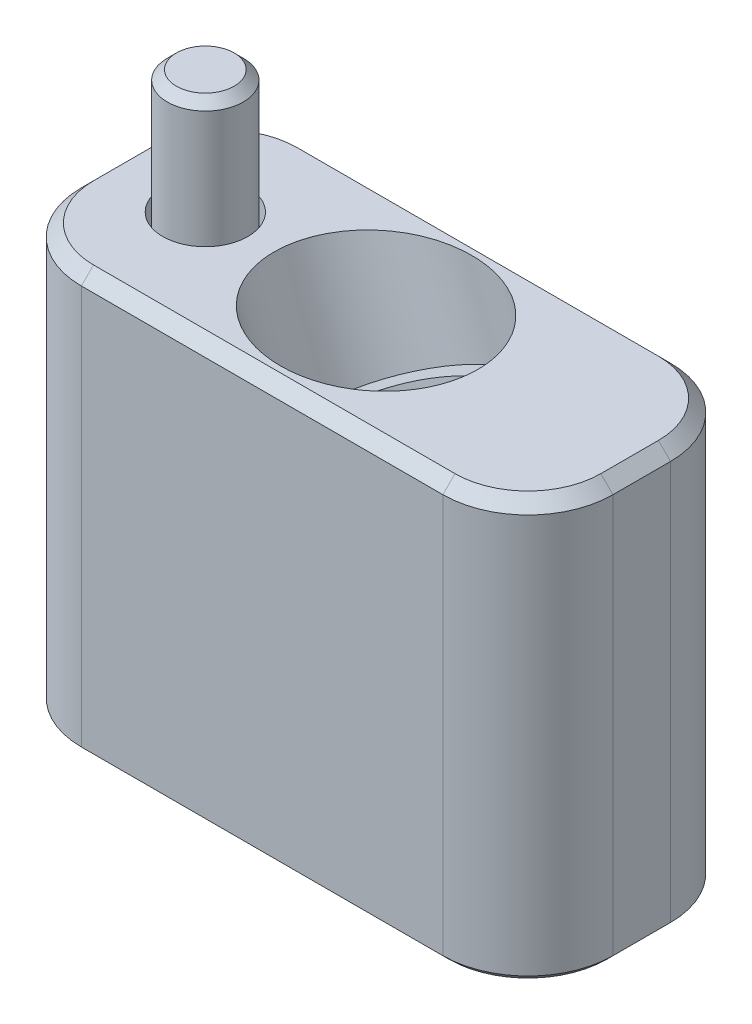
ISO-10303-21;
HEADER;
FILE_DESCRIPTION(('STEP AP214'),'2;1');
FILE_NAME('part.step','',(''),(''),'','','');
FILE_SCHEMA(('AUTOMOTIVE_DESIGN { 1 0 10303 214 1 1 1 1 }'));
ENDSEC;
DATA;
#1=APPLICATION_CONTEXT('core data for automotive mechanical design processes');
#2=APPLICATION_PROTOCOL_DEFINITION('international standard','automotive_design',2000,#1);
#3=PRODUCT_CONTEXT('',#1,'mechanical');
#4=PRODUCT('Part','Part','',(#3));
#5=PRODUCT_RELATED_PRODUCT_CATEGORY('part','',(#4));
#6=PRODUCT_DEFINITION_FORMATION('','',#4);
#7=PRODUCT_DEFINITION_CONTEXT('part definition',#1,'design');
#8=PRODUCT_DEFINITION('design','',#6,#7);
#9=PRODUCT_DEFINITION_SHAPE('','',#8);
#10=(LENGTH_UNIT() NAMED_UNIT(*) SI_UNIT(.MILLI.,.METRE.));
#11=(NAMED_UNIT(*) PLANE_ANGLE_UNIT() SI_UNIT($,.RADIAN.));
#12=(NAMED_UNIT(*) SI_UNIT($,.STERADIAN.) SOLID_ANGLE_UNIT());
#13=UNCERTAINTY_MEASURE_WITH_UNIT(LENGTH_MEASURE(1.E-05),#10,'distance_accuracy_value','');
#14=(GEOMETRIC_REPRESENTATION_CONTEXT(3) GLOBAL_UNCERTAINTY_ASSIGNED_CONTEXT((#13)) GLOBAL_UNIT_ASSIGNED_CONTEXT((#10,
#11,#12)) REPRESENTATION_CONTEXT('',''));
#15=CARTESIAN_POINT('',(0.,0.,0.));
#16=DIRECTION('',(0.,0.,1.));
#17=DIRECTION('',(1.,0.,0.));
#18=AXIS2_PLACEMENT_3D('',#15,#16,#17);
#19=CARTESIAN_POINT('',(-14.2748,-34.1376,4.7625));
#20=DIRECTION('',(0.,-1.,0.));
#21=DIRECTION('',(-1.,0.,0.));
#22=AXIS2_PLACEMENT_3D('',#19,#20,#21);
#23=PLANE('',#22);
#24=CARTESIAN_POINT('',(-14.2748,-34.1376,0.));
#25=DIRECTION('',(0.,-1.,0.));
#26=DIRECTION('',(-1.,0.,0.));
#27=AXIS2_PLACEMENT_3D('',#24,#25,#26);
#28=CIRCLE('',#27,4.2545);
#29=CARTESIAN_POINT('',(-18.5293,-34.1376,0.));
#30=VERTEX_POINT('',#29);
#31=EDGE_CURVE('E12',#30,#30,#28,.T.);
#32=ORIENTED_EDGE('',*,*,#31,.T.);
#33=EDGE_LOOP('',(#32));
#34=FACE_BOUND('',#33,.T.);
#35=DIRECTION('',(0.866025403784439,0.,0.5));
#36=VECTOR('',#35,1.);
#37=CARTESIAN_POINT('',(-14.2748,-34.1376,-2.7569630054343));
#38=LINE('',#37,#36);
#39=CARTESIAN_POINT('',(-14.2748,-34.1376,-2.7569630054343));
#40=VERTEX_POINT('',#39);
#41=CARTESIAN_POINT('',(-11.8872,-34.1376,-1.37848150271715));
#42=VERTEX_POINT('',#41);
#43=EDGE_CURVE('E66',#40,#42,#38,.T.);
#44=ORIENTED_EDGE('',*,*,#43,.F.);
#45=DIRECTION('',(0.866025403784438,0.,-0.5));
#46=VECTOR('',#45,1.);
#47=CARTESIAN_POINT('',(-16.6624,-34.1376,-1.37848150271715));
#48=LINE('',#47,#46);
#49=CARTESIAN_POINT('',(-16.6624,-34.1376,-1.37848150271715));
#50=VERTEX_POINT('',#49);
#51=EDGE_CURVE('E149',#50,#40,#48,.T.);
#52=ORIENTED_EDGE('',*,*,#51,.F.);
#53=DIRECTION('',(0.,0.,-1.));
#54=VECTOR('',#53,1.);
#55=CARTESIAN_POINT('',(-16.6624,-34.1376,1.37848150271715));
#56=LINE('',#55,#54);
#57=CARTESIAN_POINT('',(-16.6624,-34.1376,1.37848150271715));
#58=VERTEX_POINT('',#57);
#59=EDGE_CURVE('E147',#58,#50,#56,.T.);
#60=ORIENTED_EDGE('',*,*,#59,.F.);
#61=DIRECTION('',(-0.866025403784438,0.,-0.5));
#62=VECTOR('',#61,1.);
#63=CARTESIAN_POINT('',(-14.2748,-34.1376,2.75696300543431));
#64=LINE('',#63,#62);
#65=CARTESIAN_POINT('',(-14.2748,-34.1376,2.75696300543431));
#66=VERTEX_POINT('',#65);
#67=EDGE_CURVE('E114',#66,#58,#64,.T.);
#68=ORIENTED_EDGE('',*,*,#67,.F.);
#69=DIRECTION('',(-0.866025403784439,0.,0.5));
#70=VECTOR('',#69,1.);
#71=CARTESIAN_POINT('',(-11.8872,-34.1376,1.37848150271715));
#72=LINE('',#71,#70);
#73=CARTESIAN_POINT('',(-11.8872,-34.1376,1.37848150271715));
#74=VERTEX_POINT('',#73);
#75=EDGE_CURVE('E143',#74,#66,#72,.T.);
#76=ORIENTED_EDGE('',*,*,#75,.F.);
#77=DIRECTION('',(0.,0.,1.));
#78=VECTOR('',#77,1.);
#79=CARTESIAN_POINT('',(-11.8872,-34.1376,-1.37848150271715));
#80=LINE('',#79,#78);
#81=EDGE_CURVE('E140',#42,#74,#80,.T.);
#82=ORIENTED_EDGE('',*,*,#81,.F.);
#83=EDGE_LOOP('',(#44,#52,#60,#68,#76,#82));
#84=FACE_BOUND('',#83,.T.);
#85=ADVANCED_FACE('F51',(#34,#84),#23,.T.);
#86=CARTESIAN_POINT('',(-14.2748,10.3124,0.));
#87=DIRECTION('',(0.,1.,0.));
#88=DIRECTION('',(1.,0.,0.));
#89=AXIS2_PLACEMENT_3D('',#86,#87,#88);
#90=CYLINDRICAL_SURFACE('',#89,4.7625);
#91=CARTESIAN_POINT('',(-14.2748,-33.6296,0.));
#92=DIRECTION('',(0.,-1.,0.));
#93=DIRECTION('',(-1.,0.,0.));
#94=AXIS2_PLACEMENT_3D('',#91,#92,#93);
#95=CIRCLE('',#94,4.7625);
#96=CARTESIAN_POINT('',(-19.0373,-33.6296,0.));
#97=VERTEX_POINT('',#96);
#98=EDGE_CURVE('E59',#97,#97,#95,.F.);
#99=ORIENTED_EDGE('',*,*,#98,.T.);
#100=EDGE_LOOP('',(#99));
#101=FACE_BOUND('',#100,.T.);
#102=CARTESIAN_POINT('',(-14.2748,-27.7876,0.));
#103=DIRECTION('',(0.,1.,0.));
#104=DIRECTION('',(1.,0.,0.));
#105=AXIS2_PLACEMENT_3D('',#102,#103,#104);
#106=CIRCLE('',#105,4.7625);
#107=CARTESIAN_POINT('',(-9.5123,-27.7876,0.));
#108=VERTEX_POINT('',#107);
#109=EDGE_CURVE('E161',#108,#108,#106,.T.);
#110=ORIENTED_EDGE('',*,*,#109,.F.);
#111=EDGE_LOOP('',(#110));
#112=FACE_BOUND('',#111,.T.);
#113=ADVANCED_FACE('F172',(#101,#112),#90,.T.);
#114=CARTESIAN_POINT('',(-14.2748,-27.7876,3.175));
#115=DIRECTION('',(0.,1.,0.));
#116=DIRECTION('',(1.,0.,0.));
#117=AXIS2_PLACEMENT_3D('',#114,#115,#116);
#118=PLANE('',#117);
#119=ORIENTED_EDGE('',*,*,#109,.T.);
#120=EDGE_LOOP('',(#119));
#121=FACE_BOUND('',#120,.T.);
#122=CARTESIAN_POINT('',(-14.2748,-27.7876,0.));
#123=DIRECTION('',(0.,1.,0.));
#124=DIRECTION('',(1.,0.,0.));
#125=AXIS2_PLACEMENT_3D('',#122,#123,#124);
#126=CIRCLE('',#125,3.175);
#127=CARTESIAN_POINT('',(-11.0998,-27.7876,0.));
#128=VERTEX_POINT('',#127);
#129=EDGE_CURVE('E153',#128,#128,#126,.T.);
#130=ORIENTED_EDGE('',*,*,#129,.F.);
#131=EDGE_LOOP('',(#130));
#132=FACE_BOUND('',#131,.T.);
#133=ADVANCED_FACE('F189',(#121,#132),#118,.T.);
#134=CARTESIAN_POINT('',(-14.2748,10.3124,0.));
#135=DIRECTION('',(0.,1.,0.));
#136=DIRECTION('',(1.,0.,0.));
#137=AXIS2_PLACEMENT_3D('',#134,#135,#136);
#138=CYLINDRICAL_SURFACE('',#137,3.175);
#139=CARTESIAN_POINT('',(-14.2748,9.55039999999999,0.));
#140=DIRECTION('',(0.,1.,0.));
#141=DIRECTION('',(1.,0.,0.));
#142=AXIS2_PLACEMENT_3D('',#139,#140,#141);
#143=CIRCLE('',#142,3.175);
#144=CARTESIAN_POINT('',(-11.0998,9.55039999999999,0.));
#145=VERTEX_POINT('',#144);
#146=EDGE_CURVE('E167',#145,#145,#143,.F.);
#147=ORIENTED_EDGE('',*,*,#146,.T.);
#148=EDGE_LOOP('',(#147));
#149=FACE_BOUND('',#148,.T.);
#150=ORIENTED_EDGE('',*,*,#129,.T.);
#151=EDGE_LOOP('',(#150));
#152=FACE_BOUND('',#151,.T.);
#153=ADVANCED_FACE('F195',(#149,#152),#138,.T.);
#154=CARTESIAN_POINT('',(-14.2748,10.3124,0.));
#155=DIRECTION('',(0.,1.,0.));
#156=DIRECTION('',(1.,0.,0.));
#157=AXIS2_PLACEMENT_3D('',#154,#155,#156);
#158=PLANE('',#157);
#159=CARTESIAN_POINT('',(-14.2748,10.3124,0.));
#160=DIRECTION('',(0.,1.,0.));
#161=DIRECTION('',(1.,0.,0.));
#162=AXIS2_PLACEMENT_3D('',#159,#160,#161);
#163=CIRCLE('',#162,2.41299999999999);
#164=CARTESIAN_POINT('',(-11.8618,10.3124,0.));
#165=VERTEX_POINT('',#164);
#166=EDGE_CURVE('E164',#165,#165,#163,.T.);
#167=ORIENTED_EDGE('',*,*,#166,.T.);
#168=EDGE_LOOP('',(#167));
#169=FACE_BOUND('',#168,.T.);
#170=ADVANCED_FACE('F199',(#169),#158,.T.);
#171=CARTESIAN_POINT('',(-14.2748,-30.5816,-2.7569630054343));
#172=DIRECTION('',(0.5,0.,-0.866025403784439));
#173=DIRECTION('',(-0.866025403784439,0.,-0.5));
#174=AXIS2_PLACEMENT_3D('',#171,#172,#173);
#175=PLANE('',#174);
#176=ORIENTED_EDGE('',*,*,#43,.T.);
#177=DIRECTION('',(0.,-1.,0.));
#178=VECTOR('',#177,1.);
#179=CARTESIAN_POINT('',(-11.8872,-30.5816,-1.37848150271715));
#180=LINE('',#179,#178);
#181=CARTESIAN_POINT('',(-11.8872,-30.5816,-1.37848150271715));
#182=VERTEX_POINT('',#181);
#183=EDGE_CURVE('E96',#182,#42,#180,.T.);
#184=ORIENTED_EDGE('',*,*,#183,.F.);
#185=DIRECTION('',(0.866025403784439,0.,0.5));
#186=VECTOR('',#185,1.);
#187=CARTESIAN_POINT('',(-14.2748,-30.5816,-2.7569630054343));
#188=LINE('',#187,#186);
#189=CARTESIAN_POINT('',(-14.2748,-30.5816,-2.7569630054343));
#190=VERTEX_POINT('',#189);
#191=EDGE_CURVE('E151',#190,#182,#188,.T.);
#192=ORIENTED_EDGE('',*,*,#191,.F.);
#193=DIRECTION('',(0.,-1.,0.));
#194=VECTOR('',#193,1.);
#195=CARTESIAN_POINT('',(-14.2748,-30.5816,-2.7569630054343));
#196=LINE('',#195,#194);
#197=EDGE_CURVE('E74',#190,#40,#196,.T.);
#198=ORIENTED_EDGE('',*,*,#197,.T.);
#199=EDGE_LOOP('',(#176,#184,#192,#198));
#200=FACE_BOUND('',#199,.T.);
#201=ADVANCED_FACE('F203',(#200),#175,.F.);
#202=CARTESIAN_POINT('',(-16.6624,-30.5816,-1.37848150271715));
#203=DIRECTION('',(-0.5,0.,-0.866025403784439));
#204=DIRECTION('',(-0.866025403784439,0.,0.5));
#205=AXIS2_PLACEMENT_3D('',#202,#203,#204);
#206=PLANE('',#205);
#207=ORIENTED_EDGE('',*,*,#51,.T.);
#208=ORIENTED_EDGE('',*,*,#197,.F.);
#209=DIRECTION('',(0.866025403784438,0.,-0.5));
#210=VECTOR('',#209,1.);
#211=CARTESIAN_POINT('',(-16.6624,-30.5816,-1.37848150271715));
#212=LINE('',#211,#210);
#213=CARTESIAN_POINT('',(-16.6624,-30.5816,-1.37848150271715));
#214=VERTEX_POINT('',#213);
#215=EDGE_CURVE('E126',#214,#190,#212,.T.);
#216=ORIENTED_EDGE('',*,*,#215,.F.);
#217=DIRECTION('',(0.,-1.,0.));
#218=VECTOR('',#217,1.);
#219=CARTESIAN_POINT('',(-16.6624,-30.5816,-1.37848150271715));
#220=LINE('',#219,#218);
#221=EDGE_CURVE('E118',#214,#50,#220,.T.);
#222=ORIENTED_EDGE('',*,*,#221,.T.);
#223=EDGE_LOOP('',(#207,#208,#216,#222));
#224=FACE_BOUND('',#223,.T.);
#225=ADVANCED_FACE('F207',(#224),#206,.F.);
#226=CARTESIAN_POINT('',(-16.6624,-30.5816,1.37848150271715));
#227=DIRECTION('',(-1.,0.,0.));
#228=DIRECTION('',(0.,1.,0.));
#229=AXIS2_PLACEMENT_3D('',#226,#227,#228);
#230=PLANE('',#229);
#231=ORIENTED_EDGE('',*,*,#59,.T.);
#232=ORIENTED_EDGE('',*,*,#221,.F.);
#233=DIRECTION('',(0.,0.,-1.));
#234=VECTOR('',#233,1.);
#235=CARTESIAN_POINT('',(-16.6624,-30.5816,1.37848150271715));
#236=LINE('',#235,#234);
#237=CARTESIAN_POINT('',(-16.6624,-30.5816,1.37848150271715));
#238=VERTEX_POINT('',#237);
#239=EDGE_CURVE('E122',#238,#214,#236,.T.);
#240=ORIENTED_EDGE('',*,*,#239,.F.);
#241=DIRECTION('',(0.,-1.,0.));
#242=VECTOR('',#241,1.);
#243=CARTESIAN_POINT('',(-16.6624,-30.5816,1.37848150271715));
#244=LINE('',#243,#242);
#245=EDGE_CURVE('E107',#238,#58,#244,.T.);
#246=ORIENTED_EDGE('',*,*,#245,.T.);
#247=EDGE_LOOP('',(#231,#232,#240,#246));
#248=FACE_BOUND('',#247,.T.);
#249=ADVANCED_FACE('F123',(#248),#230,.F.);
#250=CARTESIAN_POINT('',(-14.2748,-30.5816,2.75696300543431));
#251=DIRECTION('',(-0.5,0.,0.866025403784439));
#252=DIRECTION('',(0.866025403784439,0.,0.5));
#253=AXIS2_PLACEMENT_3D('',#250,#251,#252);
#254=PLANE('',#253);
#255=ORIENTED_EDGE('',*,*,#67,.T.);
#256=ORIENTED_EDGE('',*,*,#245,.F.);
#257=DIRECTION('',(-0.866025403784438,0.,-0.5));
#258=VECTOR('',#257,1.);
#259=CARTESIAN_POINT('',(-14.2748,-30.5816,2.75696300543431));
#260=LINE('',#259,#258);
#261=CARTESIAN_POINT('',(-14.2748,-30.5816,2.75696300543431));
#262=VERTEX_POINT('',#261);
#263=EDGE_CURVE('E111',#262,#238,#260,.T.);
#264=ORIENTED_EDGE('',*,*,#263,.F.);
#265=DIRECTION('',(0.,-1.,0.));
#266=VECTOR('',#265,1.);
#267=CARTESIAN_POINT('',(-14.2748,-30.5816,2.75696300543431));
#268=LINE('',#267,#266);
#269=EDGE_CURVE('E119',#262,#66,#268,.T.);
#270=ORIENTED_EDGE('',*,*,#269,.T.);
#271=EDGE_LOOP('',(#255,#256,#264,#270));
#272=FACE_BOUND('',#271,.T.);
#273=ADVANCED_FACE('F109',(#272),#254,.F.);
#274=CARTESIAN_POINT('',(-11.8872,-30.5816,1.37848150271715));
#275=DIRECTION('',(0.5,0.,0.866025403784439));
#276=DIRECTION('',(0.866025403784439,0.,-0.5));
#277=AXIS2_PLACEMENT_3D('',#274,#275,#276);
#278=PLANE('',#277);
#279=ORIENTED_EDGE('',*,*,#75,.T.);
#280=ORIENTED_EDGE('',*,*,#269,.F.);
#281=DIRECTION('',(-0.866025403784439,0.,0.5));
#282=VECTOR('',#281,1.);
#283=CARTESIAN_POINT('',(-11.8872,-30.5816,1.37848150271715));
#284=LINE('',#283,#282);
#285=CARTESIAN_POINT('',(-11.8872,-30.5816,1.37848150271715));
#286=VERTEX_POINT('',#285);
#287=EDGE_CURVE('E132',#286,#262,#284,.T.);
#288=ORIENTED_EDGE('',*,*,#287,.F.);
#289=DIRECTION('',(0.,-1.,0.));
#290=VECTOR('',#289,1.);
#291=CARTESIAN_POINT('',(-11.8872,-30.5816,1.37848150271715));
#292=LINE('',#291,#290);
#293=EDGE_CURVE('E156',#286,#74,#292,.T.);
#294=ORIENTED_EDGE('',*,*,#293,.T.);
#295=EDGE_LOOP('',(#279,#280,#288,#294));
#296=FACE_BOUND('',#295,.T.);
#297=ADVANCED_FACE('F211',(#296),#278,.F.);
#298=CARTESIAN_POINT('',(-11.8872,-30.5816,-1.37848150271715));
#299=DIRECTION('',(1.,0.,0.));
#300=DIRECTION('',(0.,-1.,0.));
#301=AXIS2_PLACEMENT_3D('',#298,#299,#300);
#302=PLANE('',#301);
#303=ORIENTED_EDGE('',*,*,#81,.T.);
#304=ORIENTED_EDGE('',*,*,#293,.F.);
#305=DIRECTION('',(0.,0.,1.));
#306=VECTOR('',#305,1.);
#307=CARTESIAN_POINT('',(-11.8872,-30.5816,-1.37848150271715));
#308=LINE('',#307,#306);
#309=EDGE_CURVE('E134',#182,#286,#308,.T.);
#310=ORIENTED_EDGE('',*,*,#309,.F.);
#311=ORIENTED_EDGE('',*,*,#183,.T.);
#312=EDGE_LOOP('',(#303,#304,#310,#311));
#313=FACE_BOUND('',#312,.T.);
#314=ADVANCED_FACE('F208',(#313),#302,.F.);
#315=CARTESIAN_POINT('',(-14.2748,-30.5816,-2.7569630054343));
#316=DIRECTION('',(0.,1.,0.));
#317=DIRECTION('',(1.,0.,0.));
#318=AXIS2_PLACEMENT_3D('',#315,#316,#317);
#319=PLANE('',#318);
#320=ORIENTED_EDGE('',*,*,#191,.T.);
#321=ORIENTED_EDGE('',*,*,#309,.T.);
#322=ORIENTED_EDGE('',*,*,#287,.T.);
#323=ORIENTED_EDGE('',*,*,#263,.T.);
#324=ORIENTED_EDGE('',*,*,#239,.T.);
#325=ORIENTED_EDGE('',*,*,#215,.T.);
#326=EDGE_LOOP('',(#320,#321,#322,#323,#324,#325));
#327=FACE_BOUND('',#326,.T.);
#328=ADVANCED_FACE('F129',(#327),#319,.F.);
#329=CARTESIAN_POINT('',(-14.2748,10.3124,0.));
#330=DIRECTION('',(0.,-1.,0.));
#331=DIRECTION('',(-1.,0.,0.));
#332=AXIS2_PLACEMENT_3D('',#329,#330,#331);
#333=CONICAL_SURFACE('',#332,2.41299999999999,0.78539816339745);
#334=ORIENTED_EDGE('',*,*,#146,.F.);
#335=EDGE_LOOP('',(#334));
#336=FACE_BOUND('',#335,.T.);
#337=ORIENTED_EDGE('',*,*,#166,.F.);
#338=EDGE_LOOP('',(#337));
#339=FACE_BOUND('',#338,.T.);
#340=ADVANCED_FACE('F176',(#336,#339),#333,.T.);
#341=CARTESIAN_POINT('',(-14.2748,-33.6296,0.));
#342=DIRECTION('',(0.,1.,0.));
#343=DIRECTION('',(1.,0.,0.));
#344=AXIS2_PLACEMENT_3D('',#341,#342,#343);
#345=CONICAL_SURFACE('',#344,4.7625,0.785398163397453);
#346=ORIENTED_EDGE('',*,*,#31,.F.);
#347=EDGE_LOOP('',(#346));
#348=FACE_BOUND('',#347,.T.);
#349=ORIENTED_EDGE('',*,*,#98,.F.);
#350=EDGE_LOOP('',(#349));
#351=FACE_BOUND('',#350,.T.);
#352=ADVANCED_FACE('F53',(#348,#351),#345,.T.);
#353=CLOSED_SHELL('',(#85,#113,#133,#153,#170,#201,#225,#249,#273,#297,#314,#328,#340,#352));
#354=MANIFOLD_SOLID_BREP('B2',#353);
#355=CARTESIAN_POINT('',(-10.7188,-27.7876,0.));
#356=DIRECTION('',(0.,1.,0.));
#357=DIRECTION('',(0.,0.,1.));
#358=AXIS2_PLACEMENT_3D('',#355,#356,#357);
#359=PLANE('',#358);
#360=CARTESIAN_POINT('',(-14.2748,-27.7876,0.));
#361=DIRECTION('',(0.,-1.,0.));
#362=DIRECTION('',(0.,0.,-1.));
#363=AXIS2_PLACEMENT_3D('',#360,#361,#362);
#364=CIRCLE('',#363,5.1562);
#365=CARTESIAN_POINT('',(-14.2748,-27.7876,-5.1562));
#366=VERTEX_POINT('',#365);
#367=EDGE_CURVE('E538',#366,#366,#364,.T.);
#368=ORIENTED_EDGE('',*,*,#367,.T.);
#369=EDGE_LOOP('',(#368));
#370=FACE_BOUND('',#369,.T.);
#371=CARTESIAN_POINT('',(-14.2748,-27.7876,0.));
#372=DIRECTION('',(0.,-1.,0.));
#373=DIRECTION('',(0.,0.,-1.));
#374=AXIS2_PLACEMENT_3D('',#371,#372,#373);
#375=CIRCLE('',#374,3.5687);
#376=CARTESIAN_POINT('',(-14.2748,-27.7876,-3.5687));
#377=VERTEX_POINT('',#376);
#378=EDGE_CURVE('E524',#377,#377,#375,.T.);
#379=ORIENTED_EDGE('',*,*,#378,.F.);
#380=EDGE_LOOP('',(#379));
#381=FACE_BOUND('',#380,.T.);
#382=ADVANCED_FACE('F316',(#370,#381),#359,.F.);
#383=CARTESIAN_POINT('',(15.1003,-34.8996,-2.40665));
#384=DIRECTION('',(0.,1.,0.));
#385=DIRECTION('',(0.,0.,1.));
#386=AXIS2_PLACEMENT_3D('',#383,#384,#385);
#387=CYLINDRICAL_SURFACE('',#386,7.112);
#388=DIRECTION('',(0.,1.,0.));
#389=VECTOR('',#388,1.);
#390=CARTESIAN_POINT('',(22.2123,-34.8996,-2.40665));
#391=LINE('',#390,#389);
#392=CARTESIAN_POINT('',(22.2123,-34.3916,-2.40665));
#393=VERTEX_POINT('',#392);
#394=CARTESIAN_POINT('',(22.2123,-1.016,-2.40665));
#395=VERTEX_POINT('',#394);
#396=EDGE_CURVE('E453',#393,#395,#391,.T.);
#397=ORIENTED_EDGE('',*,*,#396,.F.);
#398=CARTESIAN_POINT('',(15.1003,-34.3916,-2.40665));
#399=DIRECTION('',(0.,-1.,0.));
#400=DIRECTION('',(0.,0.,-1.));
#401=AXIS2_PLACEMENT_3D('',#398,#399,#400);
#402=CIRCLE('',#401,7.112);
#403=CARTESIAN_POINT('',(15.1003,-34.3916,-9.51865));
#404=VERTEX_POINT('',#403);
#405=EDGE_CURVE('E495',#393,#404,#402,.F.);
#406=ORIENTED_EDGE('',*,*,#405,.T.);
#407=DIRECTION('',(0.,1.,0.));
#408=VECTOR('',#407,1.);
#409=CARTESIAN_POINT('',(15.1003,-34.8996,-9.51865));
#410=LINE('',#409,#408);
#411=CARTESIAN_POINT('',(15.1003,-1.016,-9.51865));
#412=VERTEX_POINT('',#411);
#413=EDGE_CURVE('E564',#404,#412,#410,.T.);
#414=ORIENTED_EDGE('',*,*,#413,.T.);
#415=CARTESIAN_POINT('',(15.1003,-1.016,-2.40665));
#416=DIRECTION('',(0.,-1.,0.));
#417=DIRECTION('',(0.,0.,-1.));
#418=AXIS2_PLACEMENT_3D('',#415,#416,#417);
#419=CIRCLE('',#418,7.112);
#420=EDGE_CURVE('E587',#412,#395,#419,.T.);
#421=ORIENTED_EDGE('',*,*,#420,.T.);
#422=EDGE_LOOP('',(#397,#406,#414,#421));
#423=FACE_BOUND('',#422,.T.);
#424=ADVANCED_FACE('F683',(#423),#387,.T.);
#425=CARTESIAN_POINT('',(22.2123,-34.8996,2.40665));
#426=DIRECTION('',(1.,0.,0.));
#427=DIRECTION('',(0.,0.,-1.));
#428=AXIS2_PLACEMENT_3D('',#425,#426,#427);
#429=PLANE('',#428);
#430=DIRECTION('',(0.,1.,0.));
#431=VECTOR('',#430,1.);
#432=CARTESIAN_POINT('',(22.2123,-34.8996,2.40665));
#433=LINE('',#432,#431);
#434=CARTESIAN_POINT('',(22.2123,-34.3916,2.40665));
#435=VERTEX_POINT('',#434);
#436=CARTESIAN_POINT('',(22.2123,-1.016,2.40665));
#437=VERTEX_POINT('',#436);
#438=EDGE_CURVE('E552',#435,#437,#433,.T.);
#439=ORIENTED_EDGE('',*,*,#438,.F.);
#440=DIRECTION('',(0.,0.,-1.));
#441=VECTOR('',#440,1.);
#442=CARTESIAN_POINT('',(22.2123,-34.3916,2.40665));
#443=LINE('',#442,#441);
#444=EDGE_CURVE('E499',#435,#393,#443,.T.);
#445=ORIENTED_EDGE('',*,*,#444,.T.);
#446=ORIENTED_EDGE('',*,*,#396,.T.);
#447=DIRECTION('',(0.,0.,1.));
#448=VECTOR('',#447,1.);
#449=CARTESIAN_POINT('',(22.2123,-1.016,2.40665));
#450=LINE('',#449,#448);
#451=EDGE_CURVE('E593',#395,#437,#450,.T.);
#452=ORIENTED_EDGE('',*,*,#451,.T.);
#453=EDGE_LOOP('',(#439,#445,#446,#452));
#454=FACE_BOUND('',#453,.T.);
#455=ADVANCED_FACE('F679',(#454),#429,.T.);
#456=CARTESIAN_POINT('',(15.1003,-34.8996,2.40665));
#457=DIRECTION('',(0.,1.,0.));
#458=DIRECTION('',(0.,0.,1.));
#459=AXIS2_PLACEMENT_3D('',#456,#457,#458);
#460=CYLINDRICAL_SURFACE('',#459,7.112);
#461=DIRECTION('',(0.,1.,0.));
#462=VECTOR('',#461,1.);
#463=CARTESIAN_POINT('',(15.1003,-34.8996,9.51865));
#464=LINE('',#463,#462);
#465=CARTESIAN_POINT('',(15.1003,-34.3916,9.51865));
#466=VERTEX_POINT('',#465);
#467=CARTESIAN_POINT('',(15.1003,-1.016,9.51865));
#468=VERTEX_POINT('',#467);
#469=EDGE_CURVE('E554',#466,#468,#464,.T.);
#470=ORIENTED_EDGE('',*,*,#469,.F.);
#471=CARTESIAN_POINT('',(15.1003,-34.3916,2.40665));
#472=DIRECTION('',(0.,-1.,0.));
#473=DIRECTION('',(0.,0.,-1.));
#474=AXIS2_PLACEMENT_3D('',#471,#472,#473);
#475=CIRCLE('',#474,7.112);
#476=EDGE_CURVE('E325',#466,#435,#475,.F.);
#477=ORIENTED_EDGE('',*,*,#476,.T.);
#478=ORIENTED_EDGE('',*,*,#438,.T.);
#479=CARTESIAN_POINT('',(15.1003,-1.016,2.40665));
#480=DIRECTION('',(0.,-1.,0.));
#481=DIRECTION('',(0.,0.,-1.));
#482=AXIS2_PLACEMENT_3D('',#479,#480,#481);
#483=CIRCLE('',#482,7.112);
#484=EDGE_CURVE('E597',#437,#468,#483,.T.);
#485=ORIENTED_EDGE('',*,*,#484,.T.);
#486=EDGE_LOOP('',(#470,#477,#478,#485));
#487=FACE_BOUND('',#486,.T.);
#488=ADVANCED_FACE('F677',(#487),#460,.T.);
#489=CARTESIAN_POINT('',(15.1003,-34.8996,9.51865));
#490=DIRECTION('',(0.,0.,1.));
#491=DIRECTION('',(1.,0.,0.));
#492=AXIS2_PLACEMENT_3D('',#489,#490,#491);
#493=PLANE('',#492);
#494=DIRECTION('',(0.,1.,0.));
#495=VECTOR('',#494,1.);
#496=CARTESIAN_POINT('',(-15.113,-34.8996,9.51865));
#497=LINE('',#496,#495);
#498=CARTESIAN_POINT('',(-15.113,-34.3916,9.51865));
#499=VERTEX_POINT('',#498);
#500=CARTESIAN_POINT('',(-15.113,-1.016,9.51865));
#501=VERTEX_POINT('',#500);
#502=EDGE_CURVE('E556',#499,#501,#497,.T.);
#503=ORIENTED_EDGE('',*,*,#502,.F.);
#504=DIRECTION('',(1.,0.,0.));
#505=VECTOR('',#504,1.);
#506=CARTESIAN_POINT('',(15.1003,-34.3916,9.51865));
#507=LINE('',#506,#505);
#508=EDGE_CURVE('E49',#499,#466,#507,.T.);
#509=ORIENTED_EDGE('',*,*,#508,.T.);
#510=ORIENTED_EDGE('',*,*,#469,.T.);
#511=DIRECTION('',(-1.,0.,0.));
#512=VECTOR('',#511,1.);
#513=CARTESIAN_POINT('',(-15.113,-1.016,9.51865));
#514=LINE('',#513,#512);
#515=EDGE_CURVE('E476',#468,#501,#514,.T.);
#516=ORIENTED_EDGE('',*,*,#515,.T.);
#517=EDGE_LOOP('',(#503,#509,#510,#516));
#518=FACE_BOUND('',#517,.T.);
#519=ADVANCED_FACE('F621',(#518),#493,.T.);
#520=CARTESIAN_POINT('',(-15.113,-34.8996,2.40665));
#521=DIRECTION('',(0.,1.,0.));
#522=DIRECTION('',(0.,0.,1.));
#523=AXIS2_PLACEMENT_3D('',#520,#521,#522);
#524=CYLINDRICAL_SURFACE('',#523,7.112);
#525=DIRECTION('',(0.,1.,0.));
#526=VECTOR('',#525,1.);
#527=CARTESIAN_POINT('',(-22.225,-34.8996,2.40665));
#528=LINE('',#527,#526);
#529=CARTESIAN_POINT('',(-22.225,-34.3916,2.40665));
#530=VERTEX_POINT('',#529);
#531=CARTESIAN_POINT('',(-22.225,-1.016,2.40665));
#532=VERTEX_POINT('',#531);
#533=EDGE_CURVE('E558',#530,#532,#528,.T.);
#534=ORIENTED_EDGE('',*,*,#533,.F.);
#535=CARTESIAN_POINT('',(-15.113,-34.3916,2.40665));
#536=DIRECTION('',(0.,-1.,0.));
#537=DIRECTION('',(0.,0.,-1.));
#538=AXIS2_PLACEMENT_3D('',#535,#536,#537);
#539=CIRCLE('',#538,7.112);
#540=EDGE_CURVE('E339',#530,#499,#539,.F.);
#541=ORIENTED_EDGE('',*,*,#540,.T.);
#542=ORIENTED_EDGE('',*,*,#502,.T.);
#543=CARTESIAN_POINT('',(-15.113,-1.016,2.40665));
#544=DIRECTION('',(0.,-1.,0.));
#545=DIRECTION('',(0.,0.,-1.));
#546=AXIS2_PLACEMENT_3D('',#543,#544,#545);
#547=CIRCLE('',#546,7.112);
#548=EDGE_CURVE('E457',#501,#532,#547,.T.);
#549=ORIENTED_EDGE('',*,*,#548,.T.);
#550=EDGE_LOOP('',(#534,#541,#542,#549));
#551=FACE_BOUND('',#550,.T.);
#552=ADVANCED_FACE('F620',(#551),#524,.T.);
#553=CARTESIAN_POINT('',(-22.225,-34.8996,2.40665));
#554=DIRECTION('',(-1.,0.,0.));
#555=DIRECTION('',(0.,0.,1.));
#556=AXIS2_PLACEMENT_3D('',#553,#554,#555);
#557=PLANE('',#556);
#558=DIRECTION('',(0.,1.,0.));
#559=VECTOR('',#558,1.);
#560=CARTESIAN_POINT('',(-22.225,-34.8996,-2.40665));
#561=LINE('',#560,#559);
#562=CARTESIAN_POINT('',(-22.225,-34.3916,-2.40665));
#563=VERTEX_POINT('',#562);
#564=CARTESIAN_POINT('',(-22.225,-1.016,-2.40665));
#565=VERTEX_POINT('',#564);
#566=EDGE_CURVE('E560',#563,#565,#561,.T.);
#567=ORIENTED_EDGE('',*,*,#566,.F.);
#568=DIRECTION('',(0.,0.,1.));
#569=VECTOR('',#568,1.);
#570=CARTESIAN_POINT('',(-22.225,-34.3916,2.40665));
#571=LINE('',#570,#569);
#572=EDGE_CURVE('E497',#563,#530,#571,.T.);
#573=ORIENTED_EDGE('',*,*,#572,.T.);
#574=ORIENTED_EDGE('',*,*,#533,.T.);
#575=DIRECTION('',(0.,0.,-1.));
#576=VECTOR('',#575,1.);
#577=CARTESIAN_POINT('',(-22.225,-1.016,-2.40665));
#578=LINE('',#577,#576);
#579=EDGE_CURVE('E590',#532,#565,#578,.T.);
#580=ORIENTED_EDGE('',*,*,#579,.T.);
#581=EDGE_LOOP('',(#567,#573,#574,#580));
#582=FACE_BOUND('',#581,.T.);
#583=ADVANCED_FACE('F618',(#582),#557,.T.);
#584=CARTESIAN_POINT('',(-15.113,-34.8996,-2.40665));
#585=DIRECTION('',(0.,1.,0.));
#586=DIRECTION('',(0.,0.,1.));
#587=AXIS2_PLACEMENT_3D('',#584,#585,#586);
#588=CYLINDRICAL_SURFACE('',#587,7.112);
#589=DIRECTION('',(0.,1.,0.));
#590=VECTOR('',#589,1.);
#591=CARTESIAN_POINT('',(-15.113,-34.8996,-9.51865));
#592=LINE('',#591,#590);
#593=CARTESIAN_POINT('',(-15.113,-34.3916,-9.51865));
#594=VERTEX_POINT('',#593);
#595=CARTESIAN_POINT('',(-15.113,-1.016,-9.51865));
#596=VERTEX_POINT('',#595);
#597=EDGE_CURVE('E562',#594,#596,#592,.T.);
#598=ORIENTED_EDGE('',*,*,#597,.F.);
#599=CARTESIAN_POINT('',(-15.113,-34.3916,-2.40665));
#600=DIRECTION('',(0.,-1.,0.));
#601=DIRECTION('',(0.,0.,-1.));
#602=AXIS2_PLACEMENT_3D('',#599,#600,#601);
#603=CIRCLE('',#602,7.112);
#604=EDGE_CURVE('E493',#594,#563,#603,.F.);
#605=ORIENTED_EDGE('',*,*,#604,.T.);
#606=ORIENTED_EDGE('',*,*,#566,.T.);
#607=CARTESIAN_POINT('',(-15.113,-1.016,-2.40665));
#608=DIRECTION('',(0.,-1.,0.));
#609=DIRECTION('',(0.,0.,-1.));
#610=AXIS2_PLACEMENT_3D('',#607,#608,#609);
#611=CIRCLE('',#610,7.112);
#612=EDGE_CURVE('E584',#565,#596,#611,.T.);
#613=ORIENTED_EDGE('',*,*,#612,.T.);
#614=EDGE_LOOP('',(#598,#605,#606,#613));
#615=FACE_BOUND('',#614,.T.);
#616=ADVANCED_FACE('F646',(#615),#588,.T.);
#617=CARTESIAN_POINT('',(15.1003,-34.8996,-9.51865));
#618=DIRECTION('',(0.,0.,-1.));
#619=DIRECTION('',(-1.,0.,0.));
#620=AXIS2_PLACEMENT_3D('',#617,#618,#619);
#621=PLANE('',#620);
#622=ORIENTED_EDGE('',*,*,#413,.F.);
#623=DIRECTION('',(-1.,0.,0.));
#624=VECTOR('',#623,1.);
#625=CARTESIAN_POINT('',(15.1003,-34.3916,-9.51865));
#626=LINE('',#625,#624);
#627=EDGE_CURVE('E472',#404,#594,#626,.T.);
#628=ORIENTED_EDGE('',*,*,#627,.T.);
#629=ORIENTED_EDGE('',*,*,#597,.T.);
#630=DIRECTION('',(1.,0.,0.));
#631=VECTOR('',#630,1.);
#632=CARTESIAN_POINT('',(15.1003,-1.016,-9.51865));
#633=LINE('',#632,#631);
#634=EDGE_CURVE('E581',#596,#412,#633,.T.);
#635=ORIENTED_EDGE('',*,*,#634,.T.);
#636=EDGE_LOOP('',(#622,#628,#629,#635));
#637=FACE_BOUND('',#636,.T.);
#638=ADVANCED_FACE('F649',(#637),#621,.T.);
#639=CARTESIAN_POINT('',(15.1003,-34.8996,-2.40665));
#640=DIRECTION('',(0.,-1.,0.));
#641=DIRECTION('',(0.,0.,-1.));
#642=AXIS2_PLACEMENT_3D('',#639,#640,#641);
#643=PLANE('',#642);
#644=CARTESIAN_POINT('',(-15.113,-34.8996,-2.40665));
#645=DIRECTION('',(0.,-1.,0.));
#646=DIRECTION('',(0.,0.,-1.));
#647=AXIS2_PLACEMENT_3D('',#644,#645,#646);
#648=CIRCLE('',#647,6.604);
#649=CARTESIAN_POINT('',(-21.717,-34.8996,-2.40665));
#650=VERTEX_POINT('',#649);
#651=CARTESIAN_POINT('',(-15.113,-34.8996,-9.01065));
#652=VERTEX_POINT('',#651);
#653=EDGE_CURVE('E488',#650,#652,#648,.T.);
#654=ORIENTED_EDGE('',*,*,#653,.T.);
#655=DIRECTION('',(1.,0.,0.));
#656=VECTOR('',#655,1.);
#657=CARTESIAN_POINT('',(15.1003,-34.8996,-9.01065));
#658=LINE('',#657,#656);
#659=CARTESIAN_POINT('',(15.1003,-34.8996,-9.01065));
#660=VERTEX_POINT('',#659);
#661=EDGE_CURVE('E490',#652,#660,#658,.T.);
#662=ORIENTED_EDGE('',*,*,#661,.T.);
#663=CARTESIAN_POINT('',(15.1003,-34.8996,-2.40665));
#664=DIRECTION('',(0.,-1.,0.));
#665=DIRECTION('',(0.,0.,-1.));
#666=AXIS2_PLACEMENT_3D('',#663,#664,#665);
#667=CIRCLE('',#666,6.604);
#668=CARTESIAN_POINT('',(21.7043,-34.8996,-2.40665));
#669=VERTEX_POINT('',#668);
#670=EDGE_CURVE('E486',#660,#669,#667,.T.);
#671=ORIENTED_EDGE('',*,*,#670,.T.);
#672=DIRECTION('',(0.,0.,1.));
#673=VECTOR('',#672,1.);
#674=CARTESIAN_POINT('',(21.7043,-34.8996,-2.40665));
#675=LINE('',#674,#673);
#676=CARTESIAN_POINT('',(21.7043,-34.8996,2.40665));
#677=VERTEX_POINT('',#676);
#678=EDGE_CURVE('E482',#669,#677,#675,.T.);
#679=ORIENTED_EDGE('',*,*,#678,.T.);
#680=CARTESIAN_POINT('',(15.1003,-34.8996,2.40665));
#681=DIRECTION('',(0.,-1.,0.));
#682=DIRECTION('',(0.,0.,-1.));
#683=AXIS2_PLACEMENT_3D('',#680,#681,#682);
#684=CIRCLE('',#683,6.604);
#685=CARTESIAN_POINT('',(15.1003,-34.8996,9.01064999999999));
#686=VERTEX_POINT('',#685);
#687=EDGE_CURVE('E478',#677,#686,#684,.T.);
#688=ORIENTED_EDGE('',*,*,#687,.T.);
#689=DIRECTION('',(-1.,0.,0.));
#690=VECTOR('',#689,1.);
#691=CARTESIAN_POINT('',(15.1003,-34.8996,9.01064999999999));
#692=LINE('',#691,#690);
#693=CARTESIAN_POINT('',(-15.113,-34.8996,9.01065));
#694=VERTEX_POINT('',#693);
#695=EDGE_CURVE('E475',#686,#694,#692,.T.);
#696=ORIENTED_EDGE('',*,*,#695,.T.);
#697=CARTESIAN_POINT('',(-15.113,-34.8996,2.40665));
#698=DIRECTION('',(0.,-1.,0.));
#699=DIRECTION('',(0.,0.,-1.));
#700=AXIS2_PLACEMENT_3D('',#697,#698,#699);
#701=CIRCLE('',#700,6.604);
#702=CARTESIAN_POINT('',(-21.717,-34.8996,2.40665));
#703=VERTEX_POINT('',#702);
#704=EDGE_CURVE('E480',#694,#703,#701,.T.);
#705=ORIENTED_EDGE('',*,*,#704,.T.);
#706=DIRECTION('',(0.,0.,-1.));
#707=VECTOR('',#706,1.);
#708=CARTESIAN_POINT('',(-21.717,-34.8996,-2.40665000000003));
#709=LINE('',#708,#707);
#710=EDGE_CURVE('E484',#703,#650,#709,.T.);
#711=ORIENTED_EDGE('',*,*,#710,.T.);
#712=EDGE_LOOP('',(#654,#662,#671,#679,#688,#696,#705,#711));
#713=FACE_BOUND('',#712,.T.);
#714=CARTESIAN_POINT('',(-14.2748,-34.8996,0.));
#715=DIRECTION('',(0.,-1.,0.));
#716=DIRECTION('',(0.,0.,-1.));
#717=AXIS2_PLACEMENT_3D('',#714,#715,#716);
#718=CIRCLE('',#717,5.1562);
#719=CARTESIAN_POINT('',(-14.2748,-34.8996,-5.1562));
#720=VERTEX_POINT('',#719);
#721=EDGE_CURVE('E470',#720,#720,#718,.T.);
#722=ORIENTED_EDGE('',*,*,#721,.F.);
#723=EDGE_LOOP('',(#722));
#724=FACE_BOUND('',#723,.T.);
#725=CARTESIAN_POINT('',(12.7024155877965,-34.8996,0.));
#726=DIRECTION('',(0.,-1.,0.));
#727=DIRECTION('',(-1.,0.,0.));
#728=AXIS2_PLACEMENT_3D('',#725,#726,#727);
#729=ELLIPSE('',#728,6.77780144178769,6.36905);
#730=CARTESIAN_POINT('',(5.92461414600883,-34.8996,0.));
#731=VERTEX_POINT('',#730);
#732=EDGE_CURVE('E566',#731,#731,#729,.T.);
#733=ORIENTED_EDGE('',*,*,#732,.F.);
#734=EDGE_LOOP('',(#733));
#735=FACE_BOUND('',#734,.T.);
#736=ADVANCED_FACE('F668',(#713,#724,#735),#643,.T.);
#737=CARTESIAN_POINT('',(15.1003,0.,-2.40665));
#738=DIRECTION('',(0.,-1.,0.));
#739=DIRECTION('',(0.,0.,-1.));
#740=AXIS2_PLACEMENT_3D('',#737,#738,#739);
#741=PLANE('',#740);
#742=CARTESIAN_POINT('',(-14.2748,0.,0.));
#743=DIRECTION('',(0.,-1.,0.));
#744=DIRECTION('',(0.,0.,-1.));
#745=AXIS2_PLACEMENT_3D('',#742,#743,#744);
#746=CIRCLE('',#745,3.55599999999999);
#747=CARTESIAN_POINT('',(-14.2748,0.,-3.55599999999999));
#748=VERTEX_POINT('',#747);
#749=EDGE_CURVE('E541',#748,#748,#746,.T.);
#750=ORIENTED_EDGE('',*,*,#749,.T.);
#751=EDGE_LOOP('',(#750));
#752=FACE_BOUND('',#751,.T.);
#753=CARTESIAN_POINT('',(15.1003,0.,-2.40665));
#754=DIRECTION('',(0.,-1.,0.));
#755=DIRECTION('',(0.,0.,-1.));
#756=AXIS2_PLACEMENT_3D('',#753,#754,#755);
#757=CIRCLE('',#756,6.096);
#758=CARTESIAN_POINT('',(21.1963,0.,-2.40665));
#759=VERTEX_POINT('',#758);
#760=CARTESIAN_POINT('',(15.1003,0.,-8.50265000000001));
#761=VERTEX_POINT('',#760);
#762=EDGE_CURVE('E574',#759,#761,#757,.F.);
#763=ORIENTED_EDGE('',*,*,#762,.T.);
#764=DIRECTION('',(-1.,0.,0.));
#765=VECTOR('',#764,1.);
#766=CARTESIAN_POINT('',(-15.113,0.,-8.50265));
#767=LINE('',#766,#765);
#768=CARTESIAN_POINT('',(-15.113,0.,-8.50265));
#769=VERTEX_POINT('',#768);
#770=EDGE_CURVE('E578',#761,#769,#767,.T.);
#771=ORIENTED_EDGE('',*,*,#770,.T.);
#772=CARTESIAN_POINT('',(-15.113,0.,-2.40665));
#773=DIRECTION('',(0.,-1.,0.));
#774=DIRECTION('',(0.,0.,-1.));
#775=AXIS2_PLACEMENT_3D('',#772,#773,#774);
#776=CIRCLE('',#775,6.096);
#777=CARTESIAN_POINT('',(-21.209,0.,-2.40665));
#778=VERTEX_POINT('',#777);
#779=EDGE_CURVE('E576',#769,#778,#776,.F.);
#780=ORIENTED_EDGE('',*,*,#779,.T.);
#781=DIRECTION('',(0.,0.,1.));
#782=VECTOR('',#781,1.);
#783=CARTESIAN_POINT('',(-21.209,0.,2.40665));
#784=LINE('',#783,#782);
#785=CARTESIAN_POINT('',(-21.209,0.,2.40665));
#786=VERTEX_POINT('',#785);
#787=EDGE_CURVE('E436',#778,#786,#784,.T.);
#788=ORIENTED_EDGE('',*,*,#787,.T.);
#789=CARTESIAN_POINT('',(-15.113,0.,2.40665));
#790=DIRECTION('',(0.,-1.,0.));
#791=DIRECTION('',(0.,0.,-1.));
#792=AXIS2_PLACEMENT_3D('',#789,#790,#791);
#793=CIRCLE('',#792,6.09600000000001);
#794=CARTESIAN_POINT('',(-15.113,0.,8.50265));
#795=VERTEX_POINT('',#794);
#796=EDGE_CURVE('E429',#786,#795,#793,.F.);
#797=ORIENTED_EDGE('',*,*,#796,.T.);
#798=DIRECTION('',(1.,0.,0.));
#799=VECTOR('',#798,1.);
#800=CARTESIAN_POINT('',(15.1003,0.,8.50265));
#801=LINE('',#800,#799);
#802=CARTESIAN_POINT('',(15.1003,0.,8.50265));
#803=VERTEX_POINT('',#802);
#804=EDGE_CURVE('E433',#795,#803,#801,.T.);
#805=ORIENTED_EDGE('',*,*,#804,.T.);
#806=CARTESIAN_POINT('',(15.1003,0.,2.40665));
#807=DIRECTION('',(0.,-1.,0.));
#808=DIRECTION('',(0.,0.,-1.));
#809=AXIS2_PLACEMENT_3D('',#806,#807,#808);
#810=CIRCLE('',#809,6.096);
#811=CARTESIAN_POINT('',(21.1963,0.,2.40665));
#812=VERTEX_POINT('',#811);
#813=EDGE_CURVE('E442',#803,#812,#810,.F.);
#814=ORIENTED_EDGE('',*,*,#813,.T.);
#815=DIRECTION('',(0.,0.,-1.));
#816=VECTOR('',#815,1.);
#817=CARTESIAN_POINT('',(21.1963,0.,-2.40665));
#818=LINE('',#817,#816);
#819=EDGE_CURVE('E441',#812,#759,#818,.T.);
#820=ORIENTED_EDGE('',*,*,#819,.T.);
#821=EDGE_LOOP('',(#763,#771,#780,#788,#797,#805,#814,#820));
#822=FACE_BOUND('',#821,.T.);
#823=CARTESIAN_POINT('',(0.,0.,0.));
#824=DIRECTION('',(0.,-1.,0.));
#825=DIRECTION('',(-1.,0.,0.));
#826=AXIS2_PLACEMENT_3D('',#823,#824,#825);
#827=ELLIPSE('',#826,8.51448635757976,8.001);
#828=CARTESIAN_POINT('',(-8.51448635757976,0.,0.));
#829=VERTEX_POINT('',#828);
#830=EDGE_CURVE('E550',#829,#829,#827,.T.);
#831=ORIENTED_EDGE('',*,*,#830,.T.);
#832=EDGE_LOOP('',(#831));
#833=FACE_BOUND('',#832,.T.);
#834=ADVANCED_FACE('F431',(#752,#822,#833),#741,.F.);
#835=CARTESIAN_POINT('',(0.,0.,0.));
#836=DIRECTION('',(-0.342020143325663,0.93969262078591,0.));
#837=DIRECTION('',(-0.939692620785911,-0.342020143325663,0.));
#838=AXIS2_PLACEMENT_3D('',#835,#836,#837);
#839=CYLINDRICAL_SURFACE('',#838,8.001);
#840=CARTESIAN_POINT('',(2.467196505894,-6.77856668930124,0.));
#841=DIRECTION('',(-0.342020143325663,0.93969262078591,0.));
#842=DIRECTION('',(-0.939692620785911,-0.342020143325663,0.));
#843=AXIS2_PLACEMENT_3D('',#840,#841,#842);
#844=CIRCLE('',#843,8.001);
#845=CARTESIAN_POINT('',(-5.05128415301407,-9.51506985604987,0.));
#846=VERTEX_POINT('',#845);
#847=EDGE_CURVE('E547',#846,#846,#844,.T.);
#848=ORIENTED_EDGE('',*,*,#847,.F.);
#849=EDGE_LOOP('',(#848));
#850=FACE_BOUND('',#849,.T.);
#851=ORIENTED_EDGE('',*,*,#830,.F.);
#852=EDGE_LOOP('',(#851));
#853=FACE_BOUND('',#852,.T.);
#854=ADVANCED_FACE('F721',(#850,#853),#839,.F.);
#855=CARTESIAN_POINT('',(-3.5177527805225,-8.95691008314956,0.));
#856=DIRECTION('',(0.342020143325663,-0.93969262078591,0.));
#857=DIRECTION('',(0.939692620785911,0.342020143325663,0.));
#858=AXIS2_PLACEMENT_3D('',#855,#856,#857);
#859=PLANE('',#858);
#860=CARTESIAN_POINT('',(2.467196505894,-6.77856668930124,0.));
#861=DIRECTION('',(-0.342020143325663,0.93969262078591,0.));
#862=DIRECTION('',(-0.939692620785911,-0.342020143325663,0.));
#863=AXIS2_PLACEMENT_3D('',#860,#861,#862);
#864=CIRCLE('',#863,6.36905);
#865=CARTESIAN_POINT('',(-3.5177527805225,-8.95691008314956,0.));
#866=VERTEX_POINT('',#865);
#867=EDGE_CURVE('E460',#866,#866,#864,.T.);
#868=ORIENTED_EDGE('',*,*,#867,.F.);
#869=EDGE_LOOP('',(#868));
#870=FACE_BOUND('',#869,.T.);
#871=ORIENTED_EDGE('',*,*,#847,.T.);
#872=EDGE_LOOP('',(#871));
#873=FACE_BOUND('',#872,.T.);
#874=ADVANCED_FACE('F717',(#870,#873),#859,.F.);
#875=CARTESIAN_POINT('',(0.,0.,0.));
#876=DIRECTION('',(-0.342020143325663,0.93969262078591,0.));
#877=DIRECTION('',(-0.939692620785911,-0.342020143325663,0.));
#878=AXIS2_PLACEMENT_3D('',#875,#876,#877);
#879=CYLINDRICAL_SURFACE('',#878,6.36905);
#880=ORIENTED_EDGE('',*,*,#732,.T.);
#881=EDGE_LOOP('',(#880));
#882=FACE_BOUND('',#881,.T.);
#883=ORIENTED_EDGE('',*,*,#867,.T.);
#884=EDGE_LOOP('',(#883));
#885=FACE_BOUND('',#884,.T.);
#886=ADVANCED_FACE('F714',(#882,#885),#879,.F.);
#887=CARTESIAN_POINT('',(15.1003,0.,8.50265));
#888=DIRECTION('',(0.,0.707106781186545,0.70710678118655));
#889=DIRECTION('',(-1.,0.,0.));
#890=AXIS2_PLACEMENT_3D('',#887,#888,#889);
#891=PLANE('',#890);
#892=DIRECTION('',(0.,0.70710678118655,-0.707106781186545));
#893=VECTOR('',#892,1.);
#894=CARTESIAN_POINT('',(-15.113,-1.016,9.51865));
#895=LINE('',#894,#893);
#896=EDGE_CURVE('E448',#501,#795,#895,.T.);
#897=ORIENTED_EDGE('',*,*,#896,.F.);
#898=ORIENTED_EDGE('',*,*,#515,.F.);
#899=DIRECTION('',(0.,-0.70710678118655,0.707106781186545));
#900=VECTOR('',#899,1.);
#901=CARTESIAN_POINT('',(15.1003,0.,8.50265));
#902=LINE('',#901,#900);
#903=EDGE_CURVE('E451',#803,#468,#902,.T.);
#904=ORIENTED_EDGE('',*,*,#903,.F.);
#905=ORIENTED_EDGE('',*,*,#804,.F.);
#906=EDGE_LOOP('',(#897,#898,#904,#905));
#907=FACE_BOUND('',#906,.T.);
#908=ADVANCED_FACE('F446',(#907),#891,.T.);
#909=CARTESIAN_POINT('',(15.1003,0.,2.40665));
#910=DIRECTION('',(0.,-1.,0.));
#911=DIRECTION('',(0.,0.,-1.));
#912=AXIS2_PLACEMENT_3D('',#909,#910,#911);
#913=CONICAL_SURFACE('',#912,6.096,0.785398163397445);
#914=ORIENTED_EDGE('',*,*,#903,.T.);
#915=ORIENTED_EDGE('',*,*,#484,.F.);
#916=DIRECTION('',(0.707106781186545,-0.70710678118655,0.));
#917=VECTOR('',#916,1.);
#918=CARTESIAN_POINT('',(21.1963,0.,2.40665));
#919=LINE('',#918,#917);
#920=EDGE_CURVE('E458',#812,#437,#919,.T.);
#921=ORIENTED_EDGE('',*,*,#920,.F.);
#922=ORIENTED_EDGE('',*,*,#813,.F.);
#923=EDGE_LOOP('',(#914,#915,#921,#922));
#924=FACE_BOUND('',#923,.T.);
#925=ADVANCED_FACE('F624',(#924),#913,.T.);
#926=CARTESIAN_POINT('',(-15.113,0.,2.40665));
#927=DIRECTION('',(0.,-1.,0.));
#928=DIRECTION('',(0.,0.,-1.));
#929=AXIS2_PLACEMENT_3D('',#926,#927,#928);
#930=CONICAL_SURFACE('',#929,6.09600000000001,0.785398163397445);
#931=ORIENTED_EDGE('',*,*,#896,.T.);
#932=ORIENTED_EDGE('',*,*,#796,.F.);
#933=DIRECTION('',(0.707106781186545,0.70710678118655,0.));
#934=VECTOR('',#933,1.);
#935=CARTESIAN_POINT('',(-22.225,-1.016,2.40665));
#936=LINE('',#935,#934);
#937=EDGE_CURVE('E463',#532,#786,#936,.T.);
#938=ORIENTED_EDGE('',*,*,#937,.F.);
#939=ORIENTED_EDGE('',*,*,#548,.F.);
#940=EDGE_LOOP('',(#931,#932,#938,#939));
#941=FACE_BOUND('',#940,.T.);
#942=ADVANCED_FACE('F455',(#941),#930,.T.);
#943=CARTESIAN_POINT('',(21.1963,0.,-2.40665));
#944=DIRECTION('',(0.70710678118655,0.707106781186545,0.));
#945=DIRECTION('',(0.,0.,1.));
#946=AXIS2_PLACEMENT_3D('',#943,#944,#945);
#947=PLANE('',#946);
#948=ORIENTED_EDGE('',*,*,#920,.T.);
#949=ORIENTED_EDGE('',*,*,#451,.F.);
#950=DIRECTION('',(0.707106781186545,-0.70710678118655,0.));
#951=VECTOR('',#950,1.);
#952=CARTESIAN_POINT('',(21.1963,0.,-2.40665));
#953=LINE('',#952,#951);
#954=EDGE_CURVE('E609',#759,#395,#953,.T.);
#955=ORIENTED_EDGE('',*,*,#954,.F.);
#956=ORIENTED_EDGE('',*,*,#819,.F.);
#957=EDGE_LOOP('',(#948,#949,#955,#956));
#958=FACE_BOUND('',#957,.T.);
#959=ADVANCED_FACE('F632',(#958),#947,.T.);
#960=CARTESIAN_POINT('',(-21.209,0.,-2.40665000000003));
#961=DIRECTION('',(-0.707106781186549,0.707106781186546,0.));
#962=DIRECTION('',(0.,0.,-1.));
#963=AXIS2_PLACEMENT_3D('',#960,#961,#962);
#964=PLANE('',#963);
#965=ORIENTED_EDGE('',*,*,#937,.T.);
#966=ORIENTED_EDGE('',*,*,#787,.F.);
#967=DIRECTION('',(0.707106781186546,0.707106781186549,0.));
#968=VECTOR('',#967,1.);
#969=CARTESIAN_POINT('',(-22.225,-1.016,-2.40665));
#970=LINE('',#969,#968);
#971=EDGE_CURVE('E606',#565,#778,#970,.T.);
#972=ORIENTED_EDGE('',*,*,#971,.F.);
#973=ORIENTED_EDGE('',*,*,#579,.F.);
#974=EDGE_LOOP('',(#965,#966,#972,#973));
#975=FACE_BOUND('',#974,.T.);
#976=ADVANCED_FACE('F613',(#975),#964,.T.);
#977=CARTESIAN_POINT('',(15.1003,0.,-2.40665));
#978=DIRECTION('',(0.,-1.,0.));
#979=DIRECTION('',(0.,0.,-1.));
#980=AXIS2_PLACEMENT_3D('',#977,#978,#979);
#981=CONICAL_SURFACE('',#980,6.096,0.785398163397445);
#982=ORIENTED_EDGE('',*,*,#954,.T.);
#983=ORIENTED_EDGE('',*,*,#420,.F.);
#984=DIRECTION('',(0.,-0.707106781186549,-0.707106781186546));
#985=VECTOR('',#984,1.);
#986=CARTESIAN_POINT('',(15.1003,0.,-8.50265000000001));
#987=LINE('',#986,#985);
#988=EDGE_CURVE('E603',#761,#412,#987,.T.);
#989=ORIENTED_EDGE('',*,*,#988,.F.);
#990=ORIENTED_EDGE('',*,*,#762,.F.);
#991=EDGE_LOOP('',(#982,#983,#989,#990));
#992=FACE_BOUND('',#991,.T.);
#993=ADVANCED_FACE('F635',(#992),#981,.T.);
#994=CARTESIAN_POINT('',(-15.113,0.,-2.40665));
#995=DIRECTION('',(0.,-1.,0.));
#996=DIRECTION('',(0.,0.,-1.));
#997=AXIS2_PLACEMENT_3D('',#994,#995,#996);
#998=CONICAL_SURFACE('',#997,6.096,0.785398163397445);
#999=ORIENTED_EDGE('',*,*,#971,.T.);
#1000=ORIENTED_EDGE('',*,*,#779,.F.);
#1001=DIRECTION('',(0.,0.707106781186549,0.707106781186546));
#1002=VECTOR('',#1001,1.);
#1003=CARTESIAN_POINT('',(-15.113,-1.016,-9.51865));
#1004=LINE('',#1003,#1002);
#1005=EDGE_CURVE('E544',#596,#769,#1004,.T.);
#1006=ORIENTED_EDGE('',*,*,#1005,.F.);
#1007=ORIENTED_EDGE('',*,*,#612,.F.);
#1008=EDGE_LOOP('',(#999,#1000,#1006,#1007));
#1009=FACE_BOUND('',#1008,.T.);
#1010=ADVANCED_FACE('F643',(#1009),#998,.T.);
#1011=CARTESIAN_POINT('',(15.1003,0.,-8.50265000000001));
#1012=DIRECTION('',(0.,0.707106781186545,-0.70710678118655));
#1013=DIRECTION('',(1.,0.,0.));
#1014=AXIS2_PLACEMENT_3D('',#1011,#1012,#1013);
#1015=PLANE('',#1014);
#1016=ORIENTED_EDGE('',*,*,#988,.T.);
#1017=ORIENTED_EDGE('',*,*,#634,.F.);
#1018=ORIENTED_EDGE('',*,*,#1005,.T.);
#1019=ORIENTED_EDGE('',*,*,#770,.F.);
#1020=EDGE_LOOP('',(#1016,#1017,#1018,#1019));
#1021=FACE_BOUND('',#1020,.T.);
#1022=ADVANCED_FACE('F639',(#1021),#1015,.T.);
#1023=CARTESIAN_POINT('',(-14.2748,-34.8996,0.));
#1024=DIRECTION('',(0.,-1.,0.));
#1025=DIRECTION('',(0.,0.,-1.));
#1026=AXIS2_PLACEMENT_3D('',#1023,#1024,#1025);
#1027=CYLINDRICAL_SURFACE('',#1026,3.556);
#1028=CARTESIAN_POINT('',(-14.2748,-12.0319690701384,0.));
#1029=DIRECTION('',(0.,-1.,0.));
#1030=DIRECTION('',(0.,0.,-1.));
#1031=AXIS2_PLACEMENT_3D('',#1028,#1029,#1030);
#1032=CIRCLE('',#1031,3.556);
#1033=CARTESIAN_POINT('',(-14.2748,-12.0319690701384,-3.556));
#1034=VERTEX_POINT('',#1033);
#1035=EDGE_CURVE('E467',#1034,#1034,#1032,.T.);
#1036=ORIENTED_EDGE('',*,*,#1035,.T.);
#1037=EDGE_LOOP('',(#1036));
#1038=FACE_BOUND('',#1037,.T.);
#1039=ORIENTED_EDGE('',*,*,#749,.F.);
#1040=EDGE_LOOP('',(#1039));
#1041=FACE_BOUND('',#1040,.T.);
#1042=ADVANCED_FACE('F710',(#1038,#1041),#1027,.F.);
#1043=CARTESIAN_POINT('',(-14.2748,-34.8996,0.));
#1044=DIRECTION('',(0.,-1.,0.));
#1045=DIRECTION('',(0.,0.,-1.));
#1046=AXIS2_PLACEMENT_3D('',#1043,#1044,#1045);
#1047=CYLINDRICAL_SURFACE('',#1046,5.1562);
#1048=ORIENTED_EDGE('',*,*,#367,.F.);
#1049=EDGE_LOOP('',(#1048));
#1050=FACE_BOUND('',#1049,.T.);
#1051=ORIENTED_EDGE('',*,*,#721,.T.);
#1052=EDGE_LOOP('',(#1051));
#1053=FACE_BOUND('',#1052,.T.);
#1054=ADVANCED_FACE('F708',(#1050,#1053),#1047,.F.);
#1055=CARTESIAN_POINT('',(-14.2748,-12.0396,0.));
#1056=DIRECTION('',(0.,-1.,0.));
#1057=DIRECTION('',(0.,0.,-1.));
#1058=AXIS2_PLACEMENT_3D('',#1055,#1056,#1057);
#1059=CONICAL_SURFACE('',#1058,3.5687,1.02974425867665);
#1060=CARTESIAN_POINT('',(-14.2748,-12.0396,0.));
#1061=DIRECTION('',(0.,-1.,0.));
#1062=DIRECTION('',(0.,0.,-1.));
#1063=AXIS2_PLACEMENT_3D('',#1060,#1061,#1062);
#1064=CIRCLE('',#1063,3.5687);
#1065=CARTESIAN_POINT('',(-14.2748,-12.0396,-3.5687));
#1066=VERTEX_POINT('',#1065);
#1067=EDGE_CURVE('E471',#1066,#1066,#1064,.T.);
#1068=ORIENTED_EDGE('',*,*,#1067,.T.);
#1069=EDGE_LOOP('',(#1068));
#1070=FACE_BOUND('',#1069,.T.);
#1071=ORIENTED_EDGE('',*,*,#1035,.F.);
#1072=EDGE_LOOP('',(#1071));
#1073=FACE_BOUND('',#1072,.T.);
#1074=ADVANCED_FACE('F819',(#1070,#1073),#1059,.F.);
#1075=CARTESIAN_POINT('',(-14.2748,-27.7876,0.));
#1076=DIRECTION('',(0.,-1.,0.));
#1077=DIRECTION('',(0.,0.,-1.));
#1078=AXIS2_PLACEMENT_3D('',#1075,#1076,#1077);
#1079=CYLINDRICAL_SURFACE('',#1078,3.5687);
#1080=ORIENTED_EDGE('',*,*,#1067,.F.);
#1081=EDGE_LOOP('',(#1080));
#1082=FACE_BOUND('',#1081,.T.);
#1083=ORIENTED_EDGE('',*,*,#378,.T.);
#1084=EDGE_LOOP('',(#1083));
#1085=FACE_BOUND('',#1084,.T.);
#1086=ADVANCED_FACE('F811',(#1082,#1085),#1079,.F.);
#1087=CARTESIAN_POINT('',(15.1003,-34.3916,9.51865));
#1088=DIRECTION('',(0.,0.707106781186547,-0.707106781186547));
#1089=DIRECTION('',(1.,0.,0.));
#1090=AXIS2_PLACEMENT_3D('',#1087,#1088,#1089);
#1091=PLANE('',#1090);
#1092=DIRECTION('',(0.,0.707106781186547,0.707106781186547));
#1093=VECTOR('',#1092,1.);
#1094=CARTESIAN_POINT('',(-15.113,-34.8996,9.01065));
#1095=LINE('',#1094,#1093);
#1096=EDGE_CURVE('E518',#694,#499,#1095,.T.);
#1097=ORIENTED_EDGE('',*,*,#1096,.F.);
#1098=ORIENTED_EDGE('',*,*,#695,.F.);
#1099=DIRECTION('',(0.,-0.707106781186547,-0.707106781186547));
#1100=VECTOR('',#1099,1.);
#1101=CARTESIAN_POINT('',(15.1003,-34.3916,9.51865));
#1102=LINE('',#1101,#1100);
#1103=EDGE_CURVE('E320',#466,#686,#1102,.T.);
#1104=ORIENTED_EDGE('',*,*,#1103,.F.);
#1105=ORIENTED_EDGE('',*,*,#508,.F.);
#1106=EDGE_LOOP('',(#1097,#1098,#1104,#1105));
#1107=FACE_BOUND('',#1106,.T.);
#1108=ADVANCED_FACE('F318',(#1107),#1091,.F.);
#1109=CARTESIAN_POINT('',(15.1003,-34.3916,2.40665));
#1110=DIRECTION('',(0.,1.,0.));
#1111=DIRECTION('',(0.,0.,1.));
#1112=AXIS2_PLACEMENT_3D('',#1109,#1110,#1111);
#1113=CONICAL_SURFACE('',#1112,7.112,0.785398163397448);
#1114=ORIENTED_EDGE('',*,*,#1103,.T.);
#1115=ORIENTED_EDGE('',*,*,#687,.F.);
#1116=DIRECTION('',(-0.707106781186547,-0.707106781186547,0.));
#1117=VECTOR('',#1116,1.);
#1118=CARTESIAN_POINT('',(22.2123,-34.3916,2.40665));
#1119=LINE('',#1118,#1117);
#1120=EDGE_CURVE('E516',#435,#677,#1119,.T.);
#1121=ORIENTED_EDGE('',*,*,#1120,.F.);
#1122=ORIENTED_EDGE('',*,*,#476,.F.);
#1123=EDGE_LOOP('',(#1114,#1115,#1121,#1122));
#1124=FACE_BOUND('',#1123,.T.);
#1125=ADVANCED_FACE('F673',(#1124),#1113,.T.);
#1126=CARTESIAN_POINT('',(-15.113,-34.3916,2.40665));
#1127=DIRECTION('',(0.,1.,0.));
#1128=DIRECTION('',(0.,0.,1.));
#1129=AXIS2_PLACEMENT_3D('',#1126,#1127,#1128);
#1130=CONICAL_SURFACE('',#1129,7.112,0.785398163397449);
#1131=ORIENTED_EDGE('',*,*,#1096,.T.);
#1132=ORIENTED_EDGE('',*,*,#540,.F.);
#1133=DIRECTION('',(-0.707106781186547,0.707106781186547,0.));
#1134=VECTOR('',#1133,1.);
#1135=CARTESIAN_POINT('',(-21.717,-34.8996,2.40665));
#1136=LINE('',#1135,#1134);
#1137=EDGE_CURVE('E513',#703,#530,#1136,.T.);
#1138=ORIENTED_EDGE('',*,*,#1137,.F.);
#1139=ORIENTED_EDGE('',*,*,#704,.F.);
#1140=EDGE_LOOP('',(#1131,#1132,#1138,#1139));
#1141=FACE_BOUND('',#1140,.T.);
#1142=ADVANCED_FACE('F666',(#1141),#1130,.T.);
#1143=CARTESIAN_POINT('',(22.2123,-34.3916,2.40665));
#1144=DIRECTION('',(-0.707106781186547,0.707106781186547,0.));
#1145=DIRECTION('',(0.,0.,-1.));
#1146=AXIS2_PLACEMENT_3D('',#1143,#1144,#1145);
#1147=PLANE('',#1146);
#1148=ORIENTED_EDGE('',*,*,#1120,.T.);
#1149=ORIENTED_EDGE('',*,*,#678,.F.);
#1150=DIRECTION('',(-0.707106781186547,-0.707106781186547,0.));
#1151=VECTOR('',#1150,1.);
#1152=CARTESIAN_POINT('',(22.2123,-34.3916,-2.40665));
#1153=LINE('',#1152,#1151);
#1154=EDGE_CURVE('E510',#393,#669,#1153,.T.);
#1155=ORIENTED_EDGE('',*,*,#1154,.F.);
#1156=ORIENTED_EDGE('',*,*,#444,.F.);
#1157=EDGE_LOOP('',(#1148,#1149,#1155,#1156));
#1158=FACE_BOUND('',#1157,.T.);
#1159=ADVANCED_FACE('F689',(#1158),#1147,.F.);
#1160=CARTESIAN_POINT('',(-22.225,-34.3916,2.40665));
#1161=DIRECTION('',(0.707106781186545,0.70710678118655,0.));
#1162=DIRECTION('',(0.,0.,1.));
#1163=AXIS2_PLACEMENT_3D('',#1160,#1161,#1162);
#1164=PLANE('',#1163);
#1165=ORIENTED_EDGE('',*,*,#1137,.T.);
#1166=ORIENTED_EDGE('',*,*,#572,.F.);
#1167=DIRECTION('',(-0.70710678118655,0.707106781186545,0.));
#1168=VECTOR('',#1167,1.);
#1169=CARTESIAN_POINT('',(-21.717,-34.8996,-2.40665));
#1170=LINE('',#1169,#1168);
#1171=EDGE_CURVE('E507',#650,#563,#1170,.T.);
#1172=ORIENTED_EDGE('',*,*,#1171,.F.);
#1173=ORIENTED_EDGE('',*,*,#710,.F.);
#1174=EDGE_LOOP('',(#1165,#1166,#1172,#1173));
#1175=FACE_BOUND('',#1174,.T.);
#1176=ADVANCED_FACE('F664',(#1175),#1164,.F.);
#1177=CARTESIAN_POINT('',(15.1003,-34.3916,-2.40665));
#1178=DIRECTION('',(0.,1.,0.));
#1179=DIRECTION('',(0.,0.,1.));
#1180=AXIS2_PLACEMENT_3D('',#1177,#1178,#1179);
#1181=CONICAL_SURFACE('',#1180,7.112,0.785398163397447);
#1182=ORIENTED_EDGE('',*,*,#1154,.T.);
#1183=ORIENTED_EDGE('',*,*,#670,.F.);
#1184=DIRECTION('',(0.,-0.707106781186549,0.707106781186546));
#1185=VECTOR('',#1184,1.);
#1186=CARTESIAN_POINT('',(15.1003,-34.3916,-9.51865));
#1187=LINE('',#1186,#1185);
#1188=EDGE_CURVE('E505',#404,#660,#1187,.T.);
#1189=ORIENTED_EDGE('',*,*,#1188,.F.);
#1190=ORIENTED_EDGE('',*,*,#405,.F.);
#1191=EDGE_LOOP('',(#1182,#1183,#1189,#1190));
#1192=FACE_BOUND('',#1191,.T.);
#1193=ADVANCED_FACE('F686',(#1192),#1181,.T.);
#1194=CARTESIAN_POINT('',(-15.113,-34.3916,-2.40665));
#1195=DIRECTION('',(0.,1.,0.));
#1196=DIRECTION('',(0.,0.,1.));
#1197=AXIS2_PLACEMENT_3D('',#1194,#1195,#1196);
#1198=CONICAL_SURFACE('',#1197,7.112,0.785398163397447);
#1199=ORIENTED_EDGE('',*,*,#1171,.T.);
#1200=ORIENTED_EDGE('',*,*,#604,.F.);
#1201=DIRECTION('',(0.,0.707106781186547,-0.707106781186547));
#1202=VECTOR('',#1201,1.);
#1203=CARTESIAN_POINT('',(-15.113,-34.8996,-9.01065));
#1204=LINE('',#1203,#1202);
#1205=EDGE_CURVE('E503',#652,#594,#1204,.T.);
#1206=ORIENTED_EDGE('',*,*,#1205,.F.);
#1207=ORIENTED_EDGE('',*,*,#653,.F.);
#1208=EDGE_LOOP('',(#1199,#1200,#1206,#1207));
#1209=FACE_BOUND('',#1208,.T.);
#1210=ADVANCED_FACE('F660',(#1209),#1198,.T.);
#1211=CARTESIAN_POINT('',(15.1003,-34.3916,-9.51865));
#1212=DIRECTION('',(0.,0.707106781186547,0.707106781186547));
#1213=DIRECTION('',(-1.,0.,0.));
#1214=AXIS2_PLACEMENT_3D('',#1211,#1212,#1213);
#1215=PLANE('',#1214);
#1216=ORIENTED_EDGE('',*,*,#1188,.T.);
#1217=ORIENTED_EDGE('',*,*,#661,.F.);
#1218=ORIENTED_EDGE('',*,*,#1205,.T.);
#1219=ORIENTED_EDGE('',*,*,#627,.F.);
#1220=EDGE_LOOP('',(#1216,#1217,#1218,#1219));
#1221=FACE_BOUND('',#1220,.T.);
#1222=ADVANCED_FACE('F653',(#1221),#1215,.F.);
#1223=CLOSED_SHELL('',(#382,#424,#455,#488,#519,#552,#583,#616,#638,#736,#834,#854,#874,#886,
#908,#925,#942,#959,#976,#993,#1010,#1022,#1042,#1054,#1074,#1086,#1108,#1125,#1142,#1159,#1176,
#1193,#1210,#1222));
#1224=MANIFOLD_SOLID_BREP('B6',#1223);
#1225=ADVANCED_BREP_SHAPE_REPRESENTATION('',(#18,#354,#1224),#14);
#1226=SHAPE_DEFINITION_REPRESENTATION(#9,#1225);
ENDSEC;
END-ISO-10303-21;
